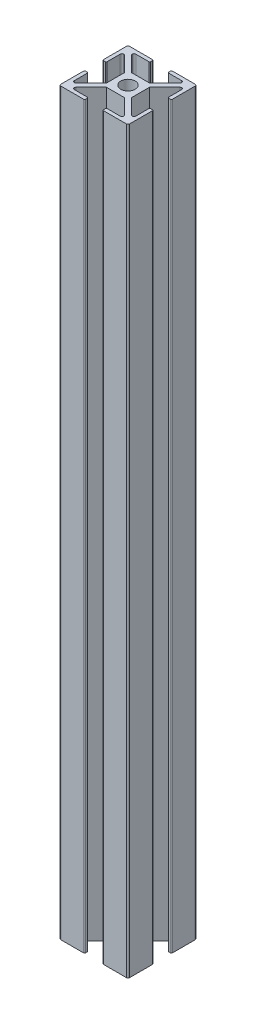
from build123d import *

# Parameters (mm, degrees)
BOSS_EXTRUDE1_DEPTH      = 215
FILLET1_R                = 0.5
FILLET2_R                = 0.25
CIRPATTERN1_COUNT        = 4
FILLET1_OF_CIRPATTERN1_R = 0.5
FILLET2_OF_CIRPATTERN1_R = 0.25


with BuildPart() as part:
    # Sketch2 → Boss-Extrude1 (new body)
    with BuildSketch(Plane(origin=(0, 0, 0), x_dir=(1, 0, 0), z_dir=(0, 1, 0))):
        Polygon((10, 8.939339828), (8.939339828, 7.878679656), (8.939339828, 2.63), (10, 2.63), align=None)
        Polygon((5.995, 7.055660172), (2.599339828, 3.66), (3.66, 3.66), (3.66, 2.599339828), (8.939339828, 7.878679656), (8.939339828, 8.939339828), (7.878679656, 8.939339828), align=None)
        Polygon((8.939339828, 10), (7.878679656, 8.939339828), (8.939339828, 8.939339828), align=None)
        Polygon((10, 8.939339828), (8.939339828, 10), (8.939339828, 8.939339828), align=None)
        Polygon((10, 10), (8.939339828, 10), (10, 8.939339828), align=None)
        Polygon((8.939339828, 8.939339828), (8.939339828, 7.878679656), (10, 8.939339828), align=None)
        Polygon((5.995, 8.939339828), (7.878679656, 8.939339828), (8.939339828, 10), (2.63, 10), (2.63, 8.939339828), align=None)
        with BuildLine():
            Line((2.599339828, 3.66), (0.852877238, 1.913537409))
            ThreePointArc((0.852877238, 1.913537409), (1.481388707, 1.481388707), (1.913537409, 0.852877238))
            Line((1.913537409, 0.852877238), (3.66, 2.599339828))
            Line((3.66, 2.599339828), (3.66, 3.66))
            Line((3.66, 3.66), (2.599339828, 3.66))
        make_face()
        with BuildLine():
            Line((-0.852877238, -1.913537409), (-2.599339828, -3.66))
            Line((-2.599339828, -3.66), (3.66, -3.66))
            Line((3.66, -3.66), (3.66, 2.599339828))
            Line((3.66, 2.599339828), (1.913537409, 0.852877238))
            ThreePointArc((1.913537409, 0.852877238), (2.04913224, 0.435984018), (2.095, 0))
            ThreePointArc((2.095, 0), (1.140668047, -1.757242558), (-0.852877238, -1.913537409))
        make_face()
        with BuildLine():
            Line((-3.66, 3.66), (-3.66, -2.599339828))
            Line((-3.66, -2.599339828), (-1.913537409, -0.852877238))
            ThreePointArc((-1.913537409, -0.852877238), (-1.481388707, 1.481388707), (0.852877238, 1.913537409))
            Line((0.852877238, 1.913537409), (2.599339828, 3.66))
            Line((2.599339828, 3.66), (-3.66, 3.66))
        make_face()
        with BuildLine():
            Line((-1.913537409, -0.852877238), (-3.66, -2.599339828))
            Line((-3.66, -2.599339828), (-3.66, -3.66))
            Line((-3.66, -3.66), (-2.599339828, -3.66))
            Line((-2.599339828, -3.66), (-0.852877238, -1.913537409))
            ThreePointArc((-0.852877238, -1.913537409), (-1.481388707, -1.481388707), (-1.913537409, -0.852877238))
        make_face()
    boss_extrude1 = extrude(amount=BOSS_EXTRUDE1_DEPTH)

    # Fillet1
    fillet1_edges = [part.edges().sort_by_distance(p)[0] for p in [
        (8.939339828, 107.5, -7.878679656),
        (7.878679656, 107.5, -8.939339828),
        (10, 107.5, -10),
    ]]
    fillet(fillet1_edges, radius=FILLET1_R)

    # Fillet2
    fillet2_edges = [part.edges().sort_by_distance(p)[0] for p in [
        (10, 107.5, -2.63),
        (8.939339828, 107.5, -2.63),
        (2.63, 107.5, -8.939339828),
        (2.63, 107.5, -10),
    ]]
    fillet(fillet2_edges, radius=FILLET2_R)

    # CirPattern1: Boss-Extrude1 ×4 about axis
    cirpattern1_axis = Axis((0, 0, 0), (0, 1, 0))
    for i in range(1, CIRPATTERN1_COUNT):
        add(boss_extrude1.rotate(cirpattern1_axis, i * 360 / CIRPATTERN1_COUNT))

    # Fillet1 of CirPattern1
    fillet1_of_cirpattern1_edges = [part.edges().sort_by_distance(p)[0] for p in [
        (-7.878679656, 107.5, -8.939339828),
        (-8.939339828, 107.5, -7.878679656),
        (-10, 107.5, -10),
        (-8.939339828, 107.5, 7.878679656),
        (-7.878679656, 107.5, 8.939339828),
        (-10, 107.5, 10),
        (7.878679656, 107.5, 8.939339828),
        (8.939339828, 107.5, 7.878679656),
        (10, 107.5, 10),
    ]]
    fillet(fillet1_of_cirpattern1_edges, radius=FILLET1_OF_CIRPATTERN1_R)

    # Fillet2 of CirPattern1
    fillet2_of_cirpattern1_edges = [part.edges().sort_by_distance(p)[0] for p in [
        (-2.63, 107.5, -10),
        (-2.63, 107.5, -8.939339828),
        (-8.939339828, 107.5, -2.63),
        (-10, 107.5, -2.63),
        (-10, 107.5, 2.63),
        (-8.939339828, 107.5, 2.63),
        (-2.63, 107.5, 8.939339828),
        (-2.63, 107.5, 10),
        (2.63, 107.5, 10),
        (2.63, 107.5, 8.939339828),
        (8.939339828, 107.5, 2.63),
        (10, 107.5, 2.63),
    ]]
    fillet(fillet2_of_cirpattern1_edges, radius=FILLET2_OF_CIRPATTERN1_R)


solid = part.part
